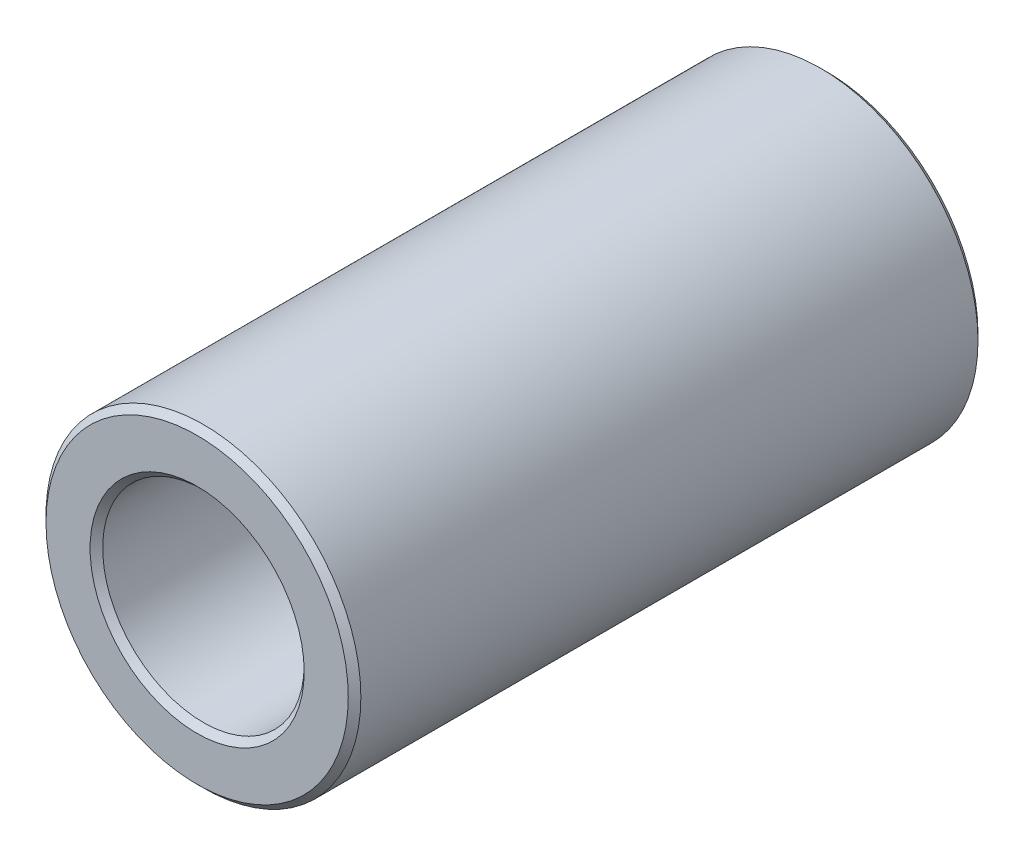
ISO-10303-21;
HEADER;
FILE_DESCRIPTION(('STEP AP214'),'2;1');
FILE_NAME('part.step','',(''),(''),'','','');
FILE_SCHEMA(('AUTOMOTIVE_DESIGN { 1 0 10303 214 1 1 1 1 }'));
ENDSEC;
DATA;
#1=APPLICATION_CONTEXT('core data for automotive mechanical design processes');
#2=APPLICATION_PROTOCOL_DEFINITION('international standard','automotive_design',2000,#1);
#3=PRODUCT_CONTEXT('',#1,'mechanical');
#4=PRODUCT('Part','Part','',(#3));
#5=PRODUCT_RELATED_PRODUCT_CATEGORY('part','',(#4));
#6=PRODUCT_DEFINITION_FORMATION('','',#4);
#7=PRODUCT_DEFINITION_CONTEXT('part definition',#1,'design');
#8=PRODUCT_DEFINITION('design','',#6,#7);
#9=PRODUCT_DEFINITION_SHAPE('','',#8);
#10=(LENGTH_UNIT() NAMED_UNIT(*) SI_UNIT(.MILLI.,.METRE.));
#11=(NAMED_UNIT(*) PLANE_ANGLE_UNIT() SI_UNIT($,.RADIAN.));
#12=(NAMED_UNIT(*) SI_UNIT($,.STERADIAN.) SOLID_ANGLE_UNIT());
#13=UNCERTAINTY_MEASURE_WITH_UNIT(LENGTH_MEASURE(1.E-05),#10,'distance_accuracy_value','');
#14=(GEOMETRIC_REPRESENTATION_CONTEXT(3) GLOBAL_UNCERTAINTY_ASSIGNED_CONTEXT((#13)) GLOBAL_UNIT_ASSIGNED_CONTEXT((#10,
#11,#12)) REPRESENTATION_CONTEXT('',''));
#15=CARTESIAN_POINT('',(0.,0.,0.));
#16=DIRECTION('',(0.,0.,1.));
#17=DIRECTION('',(1.,0.,0.));
#18=AXIS2_PLACEMENT_3D('',#15,#16,#17);
#19=CARTESIAN_POINT('',(0.,0.,10.));
#20=DIRECTION('',(0.,0.,1.));
#21=DIRECTION('',(1.,0.,0.));
#22=AXIS2_PLACEMENT_3D('',#19,#20,#21);
#23=PLANE('',#22);
#24=CARTESIAN_POINT('',(0.,0.,10.));
#25=DIRECTION('',(0.,0.,1.));
#26=DIRECTION('',(1.,0.,0.));
#27=AXIS2_PLACEMENT_3D('',#24,#25,#26);
#28=CIRCLE('',#27,3.40000000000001);
#29=CARTESIAN_POINT('',(3.40000000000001,0.,10.));
#30=VERTEX_POINT('',#29);
#31=EDGE_CURVE('E10',#30,#30,#28,.F.);
#32=ORIENTED_EDGE('',*,*,#31,.T.);
#33=EDGE_LOOP('',(#32));
#34=FACE_BOUND('',#33,.T.);
#35=CARTESIAN_POINT('',(0.,0.,10.));
#36=DIRECTION('',(0.,0.,1.));
#37=DIRECTION('',(1.,0.,0.));
#38=AXIS2_PLACEMENT_3D('',#35,#36,#37);
#39=CIRCLE('',#38,4.8);
#40=CARTESIAN_POINT('',(4.8,0.,10.));
#41=VERTEX_POINT('',#40);
#42=EDGE_CURVE('E45',#41,#41,#39,.T.);
#43=ORIENTED_EDGE('',*,*,#42,.T.);
#44=EDGE_LOOP('',(#43));
#45=FACE_BOUND('',#44,.T.);
#46=ADVANCED_FACE('F37',(#34,#45),#23,.T.);
#47=CARTESIAN_POINT('',(0.,0.,-10.));
#48=DIRECTION('',(0.,0.,1.));
#49=DIRECTION('',(1.,0.,0.));
#50=AXIS2_PLACEMENT_3D('',#47,#48,#49);
#51=PLANE('',#50);
#52=CARTESIAN_POINT('',(0.,0.,-10.));
#53=DIRECTION('',(0.,0.,1.));
#54=DIRECTION('',(1.,0.,0.));
#55=AXIS2_PLACEMENT_3D('',#52,#53,#54);
#56=CIRCLE('',#55,4.8);
#57=CARTESIAN_POINT('',(4.8,0.,-10.));
#58=VERTEX_POINT('',#57);
#59=EDGE_CURVE('E63',#58,#58,#56,.F.);
#60=ORIENTED_EDGE('',*,*,#59,.T.);
#61=EDGE_LOOP('',(#60));
#62=FACE_BOUND('',#61,.T.);
#63=CARTESIAN_POINT('',(0.,0.,-10.));
#64=DIRECTION('',(0.,0.,1.));
#65=DIRECTION('',(1.,0.,0.));
#66=AXIS2_PLACEMENT_3D('',#63,#64,#65);
#67=CIRCLE('',#66,3.4);
#68=CARTESIAN_POINT('',(3.4,0.,-10.));
#69=VERTEX_POINT('',#68);
#70=EDGE_CURVE('E66',#69,#69,#67,.T.);
#71=ORIENTED_EDGE('',*,*,#70,.T.);
#72=EDGE_LOOP('',(#71));
#73=FACE_BOUND('',#72,.T.);
#74=ADVANCED_FACE('F89',(#62,#73),#51,.F.);
#75=CARTESIAN_POINT('',(0.,0.,10.));
#76=DIRECTION('',(0.,0.,-1.));
#77=DIRECTION('',(-1.,0.,0.));
#78=AXIS2_PLACEMENT_3D('',#75,#76,#77);
#79=CYLINDRICAL_SURFACE('',#78,5.);
#80=CARTESIAN_POINT('',(0.,0.,-9.8));
#81=DIRECTION('',(0.,0.,1.));
#82=DIRECTION('',(1.,0.,0.));
#83=AXIS2_PLACEMENT_3D('',#80,#81,#82);
#84=CIRCLE('',#83,5.);
#85=CARTESIAN_POINT('',(5.,0.,-9.8));
#86=VERTEX_POINT('',#85);
#87=EDGE_CURVE('E70',#86,#86,#84,.T.);
#88=ORIENTED_EDGE('',*,*,#87,.T.);
#89=EDGE_LOOP('',(#88));
#90=FACE_BOUND('',#89,.T.);
#91=CARTESIAN_POINT('',(0.,0.,9.8));
#92=DIRECTION('',(0.,0.,1.));
#93=DIRECTION('',(1.,0.,0.));
#94=AXIS2_PLACEMENT_3D('',#91,#92,#93);
#95=CIRCLE('',#94,5.);
#96=CARTESIAN_POINT('',(5.,0.,9.8));
#97=VERTEX_POINT('',#96);
#98=EDGE_CURVE('E74',#97,#97,#95,.F.);
#99=ORIENTED_EDGE('',*,*,#98,.T.);
#100=EDGE_LOOP('',(#99));
#101=FACE_BOUND('',#100,.T.);
#102=ADVANCED_FACE('F78',(#90,#101),#79,.T.);
#103=CARTESIAN_POINT('',(0.,0.,10.));
#104=DIRECTION('',(0.,0.,-1.));
#105=DIRECTION('',(-1.,0.,0.));
#106=AXIS2_PLACEMENT_3D('',#103,#104,#105);
#107=CYLINDRICAL_SURFACE('',#106,3.2);
#108=CARTESIAN_POINT('',(0.,0.,-9.8));
#109=DIRECTION('',(0.,0.,1.));
#110=DIRECTION('',(1.,0.,0.));
#111=AXIS2_PLACEMENT_3D('',#108,#109,#110);
#112=CIRCLE('',#111,3.2);
#113=CARTESIAN_POINT('',(3.2,0.,-9.8));
#114=VERTEX_POINT('',#113);
#115=EDGE_CURVE('E52',#114,#114,#112,.F.);
#116=ORIENTED_EDGE('',*,*,#115,.T.);
#117=EDGE_LOOP('',(#116));
#118=FACE_BOUND('',#117,.T.);
#119=CARTESIAN_POINT('',(0.,0.,9.8));
#120=DIRECTION('',(0.,0.,1.));
#121=DIRECTION('',(1.,0.,0.));
#122=AXIS2_PLACEMENT_3D('',#119,#120,#121);
#123=CIRCLE('',#122,3.2);
#124=CARTESIAN_POINT('',(3.2,0.,9.8));
#125=VERTEX_POINT('',#124);
#126=EDGE_CURVE('E58',#125,#125,#123,.T.);
#127=ORIENTED_EDGE('',*,*,#126,.T.);
#128=EDGE_LOOP('',(#127));
#129=FACE_BOUND('',#128,.T.);
#130=ADVANCED_FACE('F97',(#118,#129),#107,.F.);
#131=CARTESIAN_POINT('',(0.,0.,-9.8));
#132=DIRECTION('',(0.,0.,1.));
#133=DIRECTION('',(1.,0.,0.));
#134=AXIS2_PLACEMENT_3D('',#131,#132,#133);
#135=CONICAL_SURFACE('',#134,5.,0.78539816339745);
#136=ORIENTED_EDGE('',*,*,#59,.F.);
#137=EDGE_LOOP('',(#136));
#138=FACE_BOUND('',#137,.T.);
#139=ORIENTED_EDGE('',*,*,#87,.F.);
#140=EDGE_LOOP('',(#139));
#141=FACE_BOUND('',#140,.T.);
#142=ADVANCED_FACE('F102',(#138,#141),#135,.T.);
#143=CARTESIAN_POINT('',(0.,0.,-10.));
#144=DIRECTION('',(0.,0.,-1.));
#145=DIRECTION('',(-1.,0.,0.));
#146=AXIS2_PLACEMENT_3D('',#143,#144,#145);
#147=CONICAL_SURFACE('',#146,3.4,0.785398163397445);
#148=ORIENTED_EDGE('',*,*,#115,.F.);
#149=EDGE_LOOP('',(#148));
#150=FACE_BOUND('',#149,.T.);
#151=ORIENTED_EDGE('',*,*,#70,.F.);
#152=EDGE_LOOP('',(#151));
#153=FACE_BOUND('',#152,.T.);
#154=ADVANCED_FACE('F86',(#150,#153),#147,.F.);
#155=CARTESIAN_POINT('',(0.,0.,9.8));
#156=DIRECTION('',(0.,0.,1.));
#157=DIRECTION('',(1.,0.,0.));
#158=AXIS2_PLACEMENT_3D('',#155,#156,#157);
#159=CONICAL_SURFACE('',#158,3.2,0.785398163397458);
#160=ORIENTED_EDGE('',*,*,#31,.F.);
#161=EDGE_LOOP('',(#160));
#162=FACE_BOUND('',#161,.T.);
#163=ORIENTED_EDGE('',*,*,#126,.F.);
#164=EDGE_LOOP('',(#163));
#165=FACE_BOUND('',#164,.T.);
#166=ADVANCED_FACE('F82',(#162,#165),#159,.F.);
#167=CARTESIAN_POINT('',(0.,0.,10.));
#168=DIRECTION('',(0.,0.,-1.));
#169=DIRECTION('',(-1.,0.,0.));
#170=AXIS2_PLACEMENT_3D('',#167,#168,#169);
#171=CONICAL_SURFACE('',#170,4.8,0.78539816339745);
#172=ORIENTED_EDGE('',*,*,#98,.F.);
#173=EDGE_LOOP('',(#172));
#174=FACE_BOUND('',#173,.T.);
#175=ORIENTED_EDGE('',*,*,#42,.F.);
#176=EDGE_LOOP('',(#175));
#177=FACE_BOUND('',#176,.T.);
#178=ADVANCED_FACE('F39',(#174,#177),#171,.T.);
#179=CLOSED_SHELL('',(#46,#74,#102,#130,#142,#154,#166,#178));
#180=MANIFOLD_SOLID_BREP('B2',#179);
#181=ADVANCED_BREP_SHAPE_REPRESENTATION('',(#18,#180),#14);
#182=SHAPE_DEFINITION_REPRESENTATION(#9,#181);
ENDSEC;
END-ISO-10303-21;
